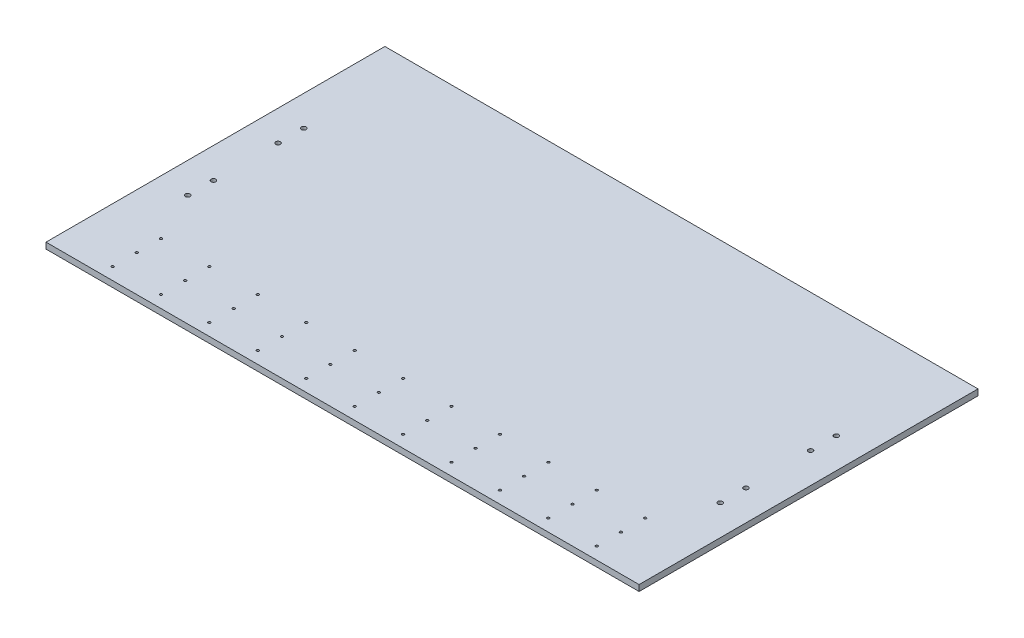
ISO-10303-21;
HEADER;
FILE_DESCRIPTION(('STEP AP214'),'2;1');
FILE_NAME('part.step','',(''),(''),'','','');
FILE_SCHEMA(('AUTOMOTIVE_DESIGN { 1 0 10303 214 1 1 1 1 }'));
ENDSEC;
DATA;
#1=APPLICATION_CONTEXT('core data for automotive mechanical design processes');
#2=APPLICATION_PROTOCOL_DEFINITION('international standard','automotive_design',2000,#1);
#3=PRODUCT_CONTEXT('',#1,'mechanical');
#4=PRODUCT('Part','Part','',(#3));
#5=PRODUCT_RELATED_PRODUCT_CATEGORY('part','',(#4));
#6=PRODUCT_DEFINITION_FORMATION('','',#4);
#7=PRODUCT_DEFINITION_CONTEXT('part definition',#1,'design');
#8=PRODUCT_DEFINITION('design','',#6,#7);
#9=PRODUCT_DEFINITION_SHAPE('','',#8);
#10=(LENGTH_UNIT() NAMED_UNIT(*) SI_UNIT(.MILLI.,.METRE.));
#11=(NAMED_UNIT(*) PLANE_ANGLE_UNIT() SI_UNIT($,.RADIAN.));
#12=(NAMED_UNIT(*) SI_UNIT($,.STERADIAN.) SOLID_ANGLE_UNIT());
#13=UNCERTAINTY_MEASURE_WITH_UNIT(LENGTH_MEASURE(1.E-05),#10,'distance_accuracy_value','');
#14=(GEOMETRIC_REPRESENTATION_CONTEXT(3) GLOBAL_UNCERTAINTY_ASSIGNED_CONTEXT((#13)) GLOBAL_UNIT_ASSIGNED_CONTEXT((#10,
#11,#12)) REPRESENTATION_CONTEXT('',''));
#15=CARTESIAN_POINT('',(0.,0.,0.));
#16=DIRECTION('',(0.,0.,1.));
#17=DIRECTION('',(1.,0.,0.));
#18=AXIS2_PLACEMENT_3D('',#15,#16,#17);
#19=CARTESIAN_POINT('',(622.3,12.7,-355.6));
#20=DIRECTION('',(-1.,0.,0.));
#21=DIRECTION('',(0.,0.,1.));
#22=AXIS2_PLACEMENT_3D('',#19,#20,#21);
#23=PLANE('',#22);
#24=DIRECTION('',(0.,0.,-1.));
#25=VECTOR('',#24,1.);
#26=CARTESIAN_POINT('',(622.3,0.,-355.6));
#27=LINE('',#26,#25);
#28=CARTESIAN_POINT('',(622.3,0.,355.6));
#29=VERTEX_POINT('',#28);
#30=CARTESIAN_POINT('',(622.3,0.,-355.6));
#31=VERTEX_POINT('',#30);
#32=EDGE_CURVE('E103',#29,#31,#27,.T.);
#33=ORIENTED_EDGE('',*,*,#32,.T.);
#34=DIRECTION('',(0.,-1.,0.));
#35=VECTOR('',#34,1.);
#36=CARTESIAN_POINT('',(622.3,12.7,-355.6));
#37=LINE('',#36,#35);
#38=CARTESIAN_POINT('',(622.3,12.7,-355.6));
#39=VERTEX_POINT('',#38);
#40=EDGE_CURVE('E94',#39,#31,#37,.T.);
#41=ORIENTED_EDGE('',*,*,#40,.F.);
#42=DIRECTION('',(0.,0.,-1.));
#43=VECTOR('',#42,1.);
#44=CARTESIAN_POINT('',(622.3,12.7,-355.6));
#45=LINE('',#44,#43);
#46=CARTESIAN_POINT('',(622.3,12.7,355.6));
#47=VERTEX_POINT('',#46);
#48=EDGE_CURVE('E88',#47,#39,#45,.T.);
#49=ORIENTED_EDGE('',*,*,#48,.F.);
#50=DIRECTION('',(0.,-1.,0.));
#51=VECTOR('',#50,1.);
#52=CARTESIAN_POINT('',(622.3,12.7,355.6));
#53=LINE('',#52,#51);
#54=EDGE_CURVE('E99',#47,#29,#53,.T.);
#55=ORIENTED_EDGE('',*,*,#54,.T.);
#56=EDGE_LOOP('',(#33,#41,#49,#55));
#57=FACE_BOUND('',#56,.T.);
#58=ADVANCED_FACE('F34',(#57),#23,.F.);
#59=CARTESIAN_POINT('',(-622.3,12.7,-355.6));
#60=DIRECTION('',(0.,0.,1.));
#61=DIRECTION('',(1.,0.,0.));
#62=AXIS2_PLACEMENT_3D('',#59,#60,#61);
#63=PLANE('',#62);
#64=DIRECTION('',(-1.,0.,0.));
#65=VECTOR('',#64,1.);
#66=CARTESIAN_POINT('',(-622.3,0.,-355.6));
#67=LINE('',#66,#65);
#68=CARTESIAN_POINT('',(-622.3,0.,-355.6));
#69=VERTEX_POINT('',#68);
#70=EDGE_CURVE('E93',#31,#69,#67,.T.);
#71=ORIENTED_EDGE('',*,*,#70,.T.);
#72=DIRECTION('',(0.,-1.,0.));
#73=VECTOR('',#72,1.);
#74=CARTESIAN_POINT('',(-622.3,12.7,-355.6));
#75=LINE('',#74,#73);
#76=CARTESIAN_POINT('',(-622.3,12.7,-355.6));
#77=VERTEX_POINT('',#76);
#78=EDGE_CURVE('E91',#77,#69,#75,.T.);
#79=ORIENTED_EDGE('',*,*,#78,.F.);
#80=DIRECTION('',(-1.,0.,0.));
#81=VECTOR('',#80,1.);
#82=CARTESIAN_POINT('',(-622.3,12.7,-355.6));
#83=LINE('',#82,#81);
#84=EDGE_CURVE('E82',#39,#77,#83,.T.);
#85=ORIENTED_EDGE('',*,*,#84,.F.);
#86=ORIENTED_EDGE('',*,*,#40,.T.);
#87=EDGE_LOOP('',(#71,#79,#85,#86));
#88=FACE_BOUND('',#87,.T.);
#89=ADVANCED_FACE('F92',(#88),#63,.F.);
#90=CARTESIAN_POINT('',(-622.3,12.7,-355.6));
#91=DIRECTION('',(1.,0.,0.));
#92=DIRECTION('',(0.,0.,-1.));
#93=AXIS2_PLACEMENT_3D('',#90,#91,#92);
#94=PLANE('',#93);
#95=DIRECTION('',(0.,0.,1.));
#96=VECTOR('',#95,1.);
#97=CARTESIAN_POINT('',(-622.3,0.,-355.6));
#98=LINE('',#97,#96);
#99=CARTESIAN_POINT('',(-622.3,0.,355.6));
#100=VERTEX_POINT('',#99);
#101=EDGE_CURVE('E68',#69,#100,#98,.T.);
#102=ORIENTED_EDGE('',*,*,#101,.T.);
#103=DIRECTION('',(0.,-1.,0.));
#104=VECTOR('',#103,1.);
#105=CARTESIAN_POINT('',(-622.3,12.7,355.6));
#106=LINE('',#105,#104);
#107=CARTESIAN_POINT('',(-622.3,12.7,355.6));
#108=VERTEX_POINT('',#107);
#109=EDGE_CURVE('E95',#108,#100,#106,.T.);
#110=ORIENTED_EDGE('',*,*,#109,.F.);
#111=DIRECTION('',(0.,0.,1.));
#112=VECTOR('',#111,1.);
#113=CARTESIAN_POINT('',(-622.3,12.7,-355.6));
#114=LINE('',#113,#112);
#115=EDGE_CURVE('E86',#77,#108,#114,.T.);
#116=ORIENTED_EDGE('',*,*,#115,.F.);
#117=ORIENTED_EDGE('',*,*,#78,.T.);
#118=EDGE_LOOP('',(#102,#110,#116,#117));
#119=FACE_BOUND('',#118,.T.);
#120=ADVANCED_FACE('F97',(#119),#94,.F.);
#121=CARTESIAN_POINT('',(-622.3,12.7,355.6));
#122=DIRECTION('',(0.,0.,-1.));
#123=DIRECTION('',(-1.,0.,0.));
#124=AXIS2_PLACEMENT_3D('',#121,#122,#123);
#125=PLANE('',#124);
#126=DIRECTION('',(1.,0.,0.));
#127=VECTOR('',#126,1.);
#128=CARTESIAN_POINT('',(-622.3,0.,355.6));
#129=LINE('',#128,#127);
#130=EDGE_CURVE('E74',#100,#29,#129,.T.);
#131=ORIENTED_EDGE('',*,*,#130,.T.);
#132=ORIENTED_EDGE('',*,*,#54,.F.);
#133=DIRECTION('',(1.,0.,0.));
#134=VECTOR('',#133,1.);
#135=CARTESIAN_POINT('',(-622.3,12.7,355.6));
#136=LINE('',#135,#134);
#137=EDGE_CURVE('E51',#108,#47,#136,.T.);
#138=ORIENTED_EDGE('',*,*,#137,.F.);
#139=ORIENTED_EDGE('',*,*,#109,.T.);
#140=EDGE_LOOP('',(#131,#132,#138,#139));
#141=FACE_BOUND('',#140,.T.);
#142=ADVANCED_FACE('F297',(#141),#125,.F.);
#143=CARTESIAN_POINT('',(0.,12.7,0.));
#144=DIRECTION('',(0.,1.,0.));
#145=DIRECTION('',(0.,0.,1.));
#146=AXIS2_PLACEMENT_3D('',#143,#144,#145);
#147=PLANE('',#146);
#148=CARTESIAN_POINT('',(-406.4,12.7,330.2));
#149=DIRECTION('',(0.,1.,0.));
#150=DIRECTION('',(0.,0.,1.));
#151=AXIS2_PLACEMENT_3D('',#148,#149,#150);
#152=CIRCLE('',#151,2.55269999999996);
#153=CARTESIAN_POINT('',(-406.4,12.7,332.7527));
#154=VERTEX_POINT('',#153);
#155=EDGE_CURVE('E880',#154,#154,#152,.T.);
#156=ORIENTED_EDGE('',*,*,#155,.F.);
#157=EDGE_LOOP('',(#156));
#158=FACE_BOUND('',#157,.T.);
#159=CARTESIAN_POINT('',(-406.4,12.7,279.4));
#160=DIRECTION('',(0.,1.,0.));
#161=DIRECTION('',(0.,0.,1.));
#162=AXIS2_PLACEMENT_3D('',#159,#160,#161);
#163=CIRCLE('',#162,2.55269999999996);
#164=CARTESIAN_POINT('',(-406.4,12.7,281.9527));
#165=VERTEX_POINT('',#164);
#166=EDGE_CURVE('E874',#165,#165,#163,.T.);
#167=ORIENTED_EDGE('',*,*,#166,.F.);
#168=EDGE_LOOP('',(#167));
#169=FACE_BOUND('',#168,.T.);
#170=CARTESIAN_POINT('',(-508.,12.7,330.2));
#171=DIRECTION('',(0.,1.,0.));
#172=DIRECTION('',(0.,0.,1.));
#173=AXIS2_PLACEMENT_3D('',#170,#171,#172);
#174=CIRCLE('',#173,2.55269999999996);
#175=CARTESIAN_POINT('',(-508.,12.7,332.7527));
#176=VERTEX_POINT('',#175);
#177=EDGE_CURVE('E871',#176,#176,#174,.T.);
#178=ORIENTED_EDGE('',*,*,#177,.F.);
#179=EDGE_LOOP('',(#178));
#180=FACE_BOUND('',#179,.T.);
#181=CARTESIAN_POINT('',(-558.8,12.7,-121.840625));
#182=DIRECTION('',(0.,1.,0.));
#183=DIRECTION('',(0.,0.,1.));
#184=AXIS2_PLACEMENT_3D('',#181,#182,#183);
#185=CIRCLE('',#184,4.90219999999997);
#186=CARTESIAN_POINT('',(-558.8,12.7,-116.938425));
#187=VERTEX_POINT('',#186);
#188=EDGE_CURVE('E865',#187,#187,#185,.T.);
#189=ORIENTED_EDGE('',*,*,#188,.F.);
#190=EDGE_LOOP('',(#189));
#191=FACE_BOUND('',#190,.T.);
#192=CARTESIAN_POINT('',(-558.8,12.7,-67.865625));
#193=DIRECTION('',(0.,1.,0.));
#194=DIRECTION('',(0.,0.,1.));
#195=AXIS2_PLACEMENT_3D('',#192,#193,#194);
#196=CIRCLE('',#195,4.90219999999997);
#197=CARTESIAN_POINT('',(-558.8,12.7,-62.963425));
#198=VERTEX_POINT('',#197);
#199=EDGE_CURVE('E859',#198,#198,#196,.T.);
#200=ORIENTED_EDGE('',*,*,#199,.F.);
#201=EDGE_LOOP('',(#200));
#202=FACE_BOUND('',#201,.T.);
#203=CARTESIAN_POINT('',(-558.8,12.7,67.865625));
#204=DIRECTION('',(0.,1.,0.));
#205=DIRECTION('',(0.,0.,1.));
#206=AXIS2_PLACEMENT_3D('',#203,#204,#205);
#207=CIRCLE('',#206,4.90219999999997);
#208=CARTESIAN_POINT('',(-558.8,12.7,72.767825));
#209=VERTEX_POINT('',#208);
#210=EDGE_CURVE('E853',#209,#209,#207,.T.);
#211=ORIENTED_EDGE('',*,*,#210,.F.);
#212=EDGE_LOOP('',(#211));
#213=FACE_BOUND('',#212,.T.);
#214=CARTESIAN_POINT('',(-558.8,12.7,121.840625));
#215=DIRECTION('',(0.,1.,0.));
#216=DIRECTION('',(0.,0.,1.));
#217=AXIS2_PLACEMENT_3D('',#214,#215,#216);
#218=CIRCLE('',#217,4.90219999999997);
#219=CARTESIAN_POINT('',(-558.8,12.7,126.742825));
#220=VERTEX_POINT('',#219);
#221=EDGE_CURVE('E847',#220,#220,#218,.T.);
#222=ORIENTED_EDGE('',*,*,#221,.F.);
#223=EDGE_LOOP('',(#222));
#224=FACE_BOUND('',#223,.T.);
#225=CARTESIAN_POINT('',(558.8,12.7,-67.865625));
#226=DIRECTION('',(0.,1.,0.));
#227=DIRECTION('',(0.,0.,1.));
#228=AXIS2_PLACEMENT_3D('',#225,#226,#227);
#229=CIRCLE('',#228,4.90219999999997);
#230=CARTESIAN_POINT('',(558.8,12.7,-62.963425));
#231=VERTEX_POINT('',#230);
#232=EDGE_CURVE('E841',#231,#231,#229,.T.);
#233=ORIENTED_EDGE('',*,*,#232,.F.);
#234=EDGE_LOOP('',(#233));
#235=FACE_BOUND('',#234,.T.);
#236=CARTESIAN_POINT('',(558.8,12.7,-121.840625));
#237=DIRECTION('',(0.,1.,0.));
#238=DIRECTION('',(0.,0.,1.));
#239=AXIS2_PLACEMENT_3D('',#236,#237,#238);
#240=CIRCLE('',#239,4.90219999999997);
#241=CARTESIAN_POINT('',(558.8,12.7,-116.938425));
#242=VERTEX_POINT('',#241);
#243=EDGE_CURVE('E835',#242,#242,#240,.T.);
#244=ORIENTED_EDGE('',*,*,#243,.F.);
#245=EDGE_LOOP('',(#244));
#246=FACE_BOUND('',#245,.T.);
#247=CARTESIAN_POINT('',(558.8,12.7,67.865625));
#248=DIRECTION('',(0.,1.,0.));
#249=DIRECTION('',(0.,0.,1.));
#250=AXIS2_PLACEMENT_3D('',#247,#248,#249);
#251=CIRCLE('',#250,4.90219999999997);
#252=CARTESIAN_POINT('',(558.8,12.7,72.767825));
#253=VERTEX_POINT('',#252);
#254=EDGE_CURVE('E827',#253,#253,#251,.T.);
#255=ORIENTED_EDGE('',*,*,#254,.F.);
#256=EDGE_LOOP('',(#255));
#257=FACE_BOUND('',#256,.T.);
#258=CARTESIAN_POINT('',(558.8,12.7,121.840625));
#259=DIRECTION('',(0.,1.,0.));
#260=DIRECTION('',(0.,0.,1.));
#261=AXIS2_PLACEMENT_3D('',#258,#259,#260);
#262=CIRCLE('',#261,4.90219999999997);
#263=CARTESIAN_POINT('',(558.8,12.7,126.742825));
#264=VERTEX_POINT('',#263);
#265=EDGE_CURVE('E821',#264,#264,#262,.T.);
#266=ORIENTED_EDGE('',*,*,#265,.F.);
#267=EDGE_LOOP('',(#266));
#268=FACE_BOUND('',#267,.T.);
#269=ORIENTED_EDGE('',*,*,#48,.T.);
#270=ORIENTED_EDGE('',*,*,#84,.T.);
#271=ORIENTED_EDGE('',*,*,#115,.T.);
#272=ORIENTED_EDGE('',*,*,#137,.T.);
#273=EDGE_LOOP('',(#269,#270,#271,#272));
#274=FACE_BOUND('',#273,.T.);
#275=CARTESIAN_POINT('',(-304.8,12.7,279.4));
#276=DIRECTION('',(0.,1.,0.));
#277=DIRECTION('',(0.,0.,1.));
#278=AXIS2_PLACEMENT_3D('',#275,#276,#277);
#279=CIRCLE('',#278,2.55269999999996);
#280=CARTESIAN_POINT('',(-304.8,12.7,281.9527));
#281=VERTEX_POINT('',#280);
#282=EDGE_CURVE('E116',#281,#281,#279,.T.);
#283=ORIENTED_EDGE('',*,*,#282,.F.);
#284=EDGE_LOOP('',(#283));
#285=FACE_BOUND('',#284,.T.);
#286=CARTESIAN_POINT('',(-203.2,12.7,279.4));
#287=DIRECTION('',(0.,1.,0.));
#288=DIRECTION('',(0.,0.,1.));
#289=AXIS2_PLACEMENT_3D('',#286,#287,#288);
#290=CIRCLE('',#289,2.55269999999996);
#291=CARTESIAN_POINT('',(-203.2,12.7,281.9527));
#292=VERTEX_POINT('',#291);
#293=EDGE_CURVE('E122',#292,#292,#290,.T.);
#294=ORIENTED_EDGE('',*,*,#293,.F.);
#295=EDGE_LOOP('',(#294));
#296=FACE_BOUND('',#295,.T.);
#297=CARTESIAN_POINT('',(-101.6,12.7,279.4));
#298=DIRECTION('',(0.,1.,0.));
#299=DIRECTION('',(0.,0.,1.));
#300=AXIS2_PLACEMENT_3D('',#297,#298,#299);
#301=CIRCLE('',#300,2.55269999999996);
#302=CARTESIAN_POINT('',(-101.6,12.7,281.9527));
#303=VERTEX_POINT('',#302);
#304=EDGE_CURVE('E128',#303,#303,#301,.T.);
#305=ORIENTED_EDGE('',*,*,#304,.F.);
#306=EDGE_LOOP('',(#305));
#307=FACE_BOUND('',#306,.T.);
#308=CARTESIAN_POINT('',(-1.11022302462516E-13,12.7,279.4));
#309=DIRECTION('',(0.,1.,0.));
#310=DIRECTION('',(0.,0.,1.));
#311=AXIS2_PLACEMENT_3D('',#308,#309,#310);
#312=CIRCLE('',#311,2.55269999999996);
#313=CARTESIAN_POINT('',(-1.11022302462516E-13,12.7,281.9527));
#314=VERTEX_POINT('',#313);
#315=EDGE_CURVE('E134',#314,#314,#312,.T.);
#316=ORIENTED_EDGE('',*,*,#315,.F.);
#317=EDGE_LOOP('',(#316));
#318=FACE_BOUND('',#317,.T.);
#319=CARTESIAN_POINT('',(101.6,12.7,279.4));
#320=DIRECTION('',(0.,1.,0.));
#321=DIRECTION('',(0.,0.,1.));
#322=AXIS2_PLACEMENT_3D('',#319,#320,#321);
#323=CIRCLE('',#322,2.55269999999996);
#324=CARTESIAN_POINT('',(101.6,12.7,281.9527));
#325=VERTEX_POINT('',#324);
#326=EDGE_CURVE('E140',#325,#325,#323,.T.);
#327=ORIENTED_EDGE('',*,*,#326,.F.);
#328=EDGE_LOOP('',(#327));
#329=FACE_BOUND('',#328,.T.);
#330=CARTESIAN_POINT('',(203.2,12.7,279.4));
#331=DIRECTION('',(0.,1.,0.));
#332=DIRECTION('',(0.,0.,1.));
#333=AXIS2_PLACEMENT_3D('',#330,#331,#332);
#334=CIRCLE('',#333,2.55269999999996);
#335=CARTESIAN_POINT('',(203.2,12.7,281.9527));
#336=VERTEX_POINT('',#335);
#337=EDGE_CURVE('E146',#336,#336,#334,.T.);
#338=ORIENTED_EDGE('',*,*,#337,.F.);
#339=EDGE_LOOP('',(#338));
#340=FACE_BOUND('',#339,.T.);
#341=CARTESIAN_POINT('',(304.8,12.7,279.4));
#342=DIRECTION('',(0.,1.,0.));
#343=DIRECTION('',(0.,0.,1.));
#344=AXIS2_PLACEMENT_3D('',#341,#342,#343);
#345=CIRCLE('',#344,2.55269999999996);
#346=CARTESIAN_POINT('',(304.8,12.7,281.9527));
#347=VERTEX_POINT('',#346);
#348=EDGE_CURVE('E152',#347,#347,#345,.T.);
#349=ORIENTED_EDGE('',*,*,#348,.F.);
#350=EDGE_LOOP('',(#349));
#351=FACE_BOUND('',#350,.T.);
#352=CARTESIAN_POINT('',(406.4,12.7,279.4));
#353=DIRECTION('',(0.,1.,0.));
#354=DIRECTION('',(0.,0.,1.));
#355=AXIS2_PLACEMENT_3D('',#352,#353,#354);
#356=CIRCLE('',#355,2.55269999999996);
#357=CARTESIAN_POINT('',(406.4,12.7,281.9527));
#358=VERTEX_POINT('',#357);
#359=EDGE_CURVE('E158',#358,#358,#356,.T.);
#360=ORIENTED_EDGE('',*,*,#359,.F.);
#361=EDGE_LOOP('',(#360));
#362=FACE_BOUND('',#361,.T.);
#363=CARTESIAN_POINT('',(-304.8,12.7,330.2));
#364=DIRECTION('',(0.,1.,0.));
#365=DIRECTION('',(0.,0.,1.));
#366=AXIS2_PLACEMENT_3D('',#363,#364,#365);
#367=CIRCLE('',#366,2.55269999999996);
#368=CARTESIAN_POINT('',(-304.8,12.7,332.7527));
#369=VERTEX_POINT('',#368);
#370=EDGE_CURVE('E164',#369,#369,#367,.T.);
#371=ORIENTED_EDGE('',*,*,#370,.F.);
#372=EDGE_LOOP('',(#371));
#373=FACE_BOUND('',#372,.T.);
#374=CARTESIAN_POINT('',(-203.2,12.7,330.2));
#375=DIRECTION('',(0.,1.,0.));
#376=DIRECTION('',(0.,0.,1.));
#377=AXIS2_PLACEMENT_3D('',#374,#375,#376);
#378=CIRCLE('',#377,2.55269999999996);
#379=CARTESIAN_POINT('',(-203.2,12.7,332.7527));
#380=VERTEX_POINT('',#379);
#381=EDGE_CURVE('E170',#380,#380,#378,.T.);
#382=ORIENTED_EDGE('',*,*,#381,.F.);
#383=EDGE_LOOP('',(#382));
#384=FACE_BOUND('',#383,.T.);
#385=CARTESIAN_POINT('',(-101.6,12.7,330.2));
#386=DIRECTION('',(0.,1.,0.));
#387=DIRECTION('',(0.,0.,1.));
#388=AXIS2_PLACEMENT_3D('',#385,#386,#387);
#389=CIRCLE('',#388,2.55269999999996);
#390=CARTESIAN_POINT('',(-101.6,12.7,332.7527));
#391=VERTEX_POINT('',#390);
#392=EDGE_CURVE('E176',#391,#391,#389,.T.);
#393=ORIENTED_EDGE('',*,*,#392,.F.);
#394=EDGE_LOOP('',(#393));
#395=FACE_BOUND('',#394,.T.);
#396=CARTESIAN_POINT('',(-1.11022302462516E-13,12.7,330.2));
#397=DIRECTION('',(0.,1.,0.));
#398=DIRECTION('',(0.,0.,1.));
#399=AXIS2_PLACEMENT_3D('',#396,#397,#398);
#400=CIRCLE('',#399,2.55269999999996);
#401=CARTESIAN_POINT('',(-1.11022302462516E-13,12.7,332.7527));
#402=VERTEX_POINT('',#401);
#403=EDGE_CURVE('E182',#402,#402,#400,.T.);
#404=ORIENTED_EDGE('',*,*,#403,.F.);
#405=EDGE_LOOP('',(#404));
#406=FACE_BOUND('',#405,.T.);
#407=CARTESIAN_POINT('',(101.6,12.7,330.2));
#408=DIRECTION('',(0.,1.,0.));
#409=DIRECTION('',(0.,0.,1.));
#410=AXIS2_PLACEMENT_3D('',#407,#408,#409);
#411=CIRCLE('',#410,2.55269999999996);
#412=CARTESIAN_POINT('',(101.6,12.7,332.7527));
#413=VERTEX_POINT('',#412);
#414=EDGE_CURVE('E188',#413,#413,#411,.T.);
#415=ORIENTED_EDGE('',*,*,#414,.F.);
#416=EDGE_LOOP('',(#415));
#417=FACE_BOUND('',#416,.T.);
#418=CARTESIAN_POINT('',(203.2,12.7,330.2));
#419=DIRECTION('',(0.,1.,0.));
#420=DIRECTION('',(0.,0.,1.));
#421=AXIS2_PLACEMENT_3D('',#418,#419,#420);
#422=CIRCLE('',#421,2.55269999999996);
#423=CARTESIAN_POINT('',(203.2,12.7,332.7527));
#424=VERTEX_POINT('',#423);
#425=EDGE_CURVE('E194',#424,#424,#422,.T.);
#426=ORIENTED_EDGE('',*,*,#425,.F.);
#427=EDGE_LOOP('',(#426));
#428=FACE_BOUND('',#427,.T.);
#429=CARTESIAN_POINT('',(304.8,12.7,330.2));
#430=DIRECTION('',(0.,1.,0.));
#431=DIRECTION('',(0.,0.,1.));
#432=AXIS2_PLACEMENT_3D('',#429,#430,#431);
#433=CIRCLE('',#432,2.55269999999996);
#434=CARTESIAN_POINT('',(304.8,12.7,332.7527));
#435=VERTEX_POINT('',#434);
#436=EDGE_CURVE('E200',#435,#435,#433,.T.);
#437=ORIENTED_EDGE('',*,*,#436,.F.);
#438=EDGE_LOOP('',(#437));
#439=FACE_BOUND('',#438,.T.);
#440=CARTESIAN_POINT('',(406.4,12.7,330.2));
#441=DIRECTION('',(0.,1.,0.));
#442=DIRECTION('',(0.,0.,1.));
#443=AXIS2_PLACEMENT_3D('',#440,#441,#442);
#444=CIRCLE('',#443,2.55269999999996);
#445=CARTESIAN_POINT('',(406.4,12.7,332.7527));
#446=VERTEX_POINT('',#445);
#447=EDGE_CURVE('E206',#446,#446,#444,.T.);
#448=ORIENTED_EDGE('',*,*,#447,.F.);
#449=EDGE_LOOP('',(#448));
#450=FACE_BOUND('',#449,.T.);
#451=CARTESIAN_POINT('',(508.,12.7,330.2));
#452=DIRECTION('',(0.,1.,0.));
#453=DIRECTION('',(0.,0.,1.));
#454=AXIS2_PLACEMENT_3D('',#451,#452,#453);
#455=CIRCLE('',#454,2.55269999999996);
#456=CARTESIAN_POINT('',(508.,12.7,332.7527));
#457=VERTEX_POINT('',#456);
#458=EDGE_CURVE('E212',#457,#457,#455,.T.);
#459=ORIENTED_EDGE('',*,*,#458,.F.);
#460=EDGE_LOOP('',(#459));
#461=FACE_BOUND('',#460,.T.);
#462=CARTESIAN_POINT('',(-508.,12.7,279.4));
#463=DIRECTION('',(0.,1.,0.));
#464=DIRECTION('',(0.,0.,1.));
#465=AXIS2_PLACEMENT_3D('',#462,#463,#464);
#466=CIRCLE('',#465,2.55269999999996);
#467=CARTESIAN_POINT('',(-508.,12.7,281.9527));
#468=VERTEX_POINT('',#467);
#469=EDGE_CURVE('E218',#468,#468,#466,.T.);
#470=ORIENTED_EDGE('',*,*,#469,.F.);
#471=EDGE_LOOP('',(#470));
#472=FACE_BOUND('',#471,.T.);
#473=CARTESIAN_POINT('',(508.,12.7,279.4));
#474=DIRECTION('',(0.,1.,0.));
#475=DIRECTION('',(0.,0.,1.));
#476=AXIS2_PLACEMENT_3D('',#473,#474,#475);
#477=CIRCLE('',#476,2.55269999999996);
#478=CARTESIAN_POINT('',(508.,12.7,281.9527));
#479=VERTEX_POINT('',#478);
#480=EDGE_CURVE('E224',#479,#479,#477,.T.);
#481=ORIENTED_EDGE('',*,*,#480,.F.);
#482=EDGE_LOOP('',(#481));
#483=FACE_BOUND('',#482,.T.);
#484=CARTESIAN_POINT('',(-508.,12.7,228.6));
#485=DIRECTION('',(0.,1.,0.));
#486=DIRECTION('',(0.,0.,1.));
#487=AXIS2_PLACEMENT_3D('',#484,#485,#486);
#488=CIRCLE('',#487,2.55269999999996);
#489=CARTESIAN_POINT('',(-508.,12.7,231.1527));
#490=VERTEX_POINT('',#489);
#491=EDGE_CURVE('E230',#490,#490,#488,.T.);
#492=ORIENTED_EDGE('',*,*,#491,.F.);
#493=EDGE_LOOP('',(#492));
#494=FACE_BOUND('',#493,.T.);
#495=CARTESIAN_POINT('',(-406.4,12.7,228.6));
#496=DIRECTION('',(0.,1.,0.));
#497=DIRECTION('',(0.,0.,1.));
#498=AXIS2_PLACEMENT_3D('',#495,#496,#497);
#499=CIRCLE('',#498,2.55269999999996);
#500=CARTESIAN_POINT('',(-406.4,12.7,231.1527));
#501=VERTEX_POINT('',#500);
#502=EDGE_CURVE('E236',#501,#501,#499,.T.);
#503=ORIENTED_EDGE('',*,*,#502,.F.);
#504=EDGE_LOOP('',(#503));
#505=FACE_BOUND('',#504,.T.);
#506=CARTESIAN_POINT('',(-304.8,12.7,228.6));
#507=DIRECTION('',(0.,1.,0.));
#508=DIRECTION('',(0.,0.,1.));
#509=AXIS2_PLACEMENT_3D('',#506,#507,#508);
#510=CIRCLE('',#509,2.55269999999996);
#511=CARTESIAN_POINT('',(-304.8,12.7,231.1527));
#512=VERTEX_POINT('',#511);
#513=EDGE_CURVE('E242',#512,#512,#510,.T.);
#514=ORIENTED_EDGE('',*,*,#513,.F.);
#515=EDGE_LOOP('',(#514));
#516=FACE_BOUND('',#515,.T.);
#517=CARTESIAN_POINT('',(-203.2,12.7,228.6));
#518=DIRECTION('',(0.,1.,0.));
#519=DIRECTION('',(0.,0.,1.));
#520=AXIS2_PLACEMENT_3D('',#517,#518,#519);
#521=CIRCLE('',#520,2.55269999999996);
#522=CARTESIAN_POINT('',(-203.2,12.7,231.1527));
#523=VERTEX_POINT('',#522);
#524=EDGE_CURVE('E248',#523,#523,#521,.T.);
#525=ORIENTED_EDGE('',*,*,#524,.F.);
#526=EDGE_LOOP('',(#525));
#527=FACE_BOUND('',#526,.T.);
#528=CARTESIAN_POINT('',(-101.6,12.7,228.6));
#529=DIRECTION('',(0.,1.,0.));
#530=DIRECTION('',(0.,0.,1.));
#531=AXIS2_PLACEMENT_3D('',#528,#529,#530);
#532=CIRCLE('',#531,2.55269999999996);
#533=CARTESIAN_POINT('',(-101.6,12.7,231.1527));
#534=VERTEX_POINT('',#533);
#535=EDGE_CURVE('E254',#534,#534,#532,.T.);
#536=ORIENTED_EDGE('',*,*,#535,.F.);
#537=EDGE_LOOP('',(#536));
#538=FACE_BOUND('',#537,.T.);
#539=CARTESIAN_POINT('',(-1.11022302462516E-13,12.7,228.6));
#540=DIRECTION('',(0.,1.,0.));
#541=DIRECTION('',(0.,0.,1.));
#542=AXIS2_PLACEMENT_3D('',#539,#540,#541);
#543=CIRCLE('',#542,2.55269999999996);
#544=CARTESIAN_POINT('',(-1.11022302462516E-13,12.7,231.1527));
#545=VERTEX_POINT('',#544);
#546=EDGE_CURVE('E260',#545,#545,#543,.T.);
#547=ORIENTED_EDGE('',*,*,#546,.F.);
#548=EDGE_LOOP('',(#547));
#549=FACE_BOUND('',#548,.T.);
#550=CARTESIAN_POINT('',(101.6,12.7,228.6));
#551=DIRECTION('',(0.,1.,0.));
#552=DIRECTION('',(0.,0.,1.));
#553=AXIS2_PLACEMENT_3D('',#550,#551,#552);
#554=CIRCLE('',#553,2.55269999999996);
#555=CARTESIAN_POINT('',(101.6,12.7,231.1527));
#556=VERTEX_POINT('',#555);
#557=EDGE_CURVE('E266',#556,#556,#554,.T.);
#558=ORIENTED_EDGE('',*,*,#557,.F.);
#559=EDGE_LOOP('',(#558));
#560=FACE_BOUND('',#559,.T.);
#561=CARTESIAN_POINT('',(203.2,12.7,228.6));
#562=DIRECTION('',(0.,1.,0.));
#563=DIRECTION('',(0.,0.,1.));
#564=AXIS2_PLACEMENT_3D('',#561,#562,#563);
#565=CIRCLE('',#564,2.55269999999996);
#566=CARTESIAN_POINT('',(203.2,12.7,231.1527));
#567=VERTEX_POINT('',#566);
#568=EDGE_CURVE('E272',#567,#567,#565,.T.);
#569=ORIENTED_EDGE('',*,*,#568,.F.);
#570=EDGE_LOOP('',(#569));
#571=FACE_BOUND('',#570,.T.);
#572=CARTESIAN_POINT('',(304.8,12.7,228.6));
#573=DIRECTION('',(0.,1.,0.));
#574=DIRECTION('',(0.,0.,1.));
#575=AXIS2_PLACEMENT_3D('',#572,#573,#574);
#576=CIRCLE('',#575,2.55269999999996);
#577=CARTESIAN_POINT('',(304.8,12.7,231.1527));
#578=VERTEX_POINT('',#577);
#579=EDGE_CURVE('E278',#578,#578,#576,.T.);
#580=ORIENTED_EDGE('',*,*,#579,.F.);
#581=EDGE_LOOP('',(#580));
#582=FACE_BOUND('',#581,.T.);
#583=CARTESIAN_POINT('',(406.4,12.7,228.6));
#584=DIRECTION('',(0.,1.,0.));
#585=DIRECTION('',(0.,0.,1.));
#586=AXIS2_PLACEMENT_3D('',#583,#584,#585);
#587=CIRCLE('',#586,2.55269999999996);
#588=CARTESIAN_POINT('',(406.4,12.7,231.1527));
#589=VERTEX_POINT('',#588);
#590=EDGE_CURVE('E284',#589,#589,#587,.T.);
#591=ORIENTED_EDGE('',*,*,#590,.F.);
#592=EDGE_LOOP('',(#591));
#593=FACE_BOUND('',#592,.T.);
#594=CARTESIAN_POINT('',(508.,12.7,228.6));
#595=DIRECTION('',(0.,1.,0.));
#596=DIRECTION('',(0.,0.,1.));
#597=AXIS2_PLACEMENT_3D('',#594,#595,#596);
#598=CIRCLE('',#597,2.55269999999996);
#599=CARTESIAN_POINT('',(508.,12.7,231.1527));
#600=VERTEX_POINT('',#599);
#601=EDGE_CURVE('E11',#600,#600,#598,.T.);
#602=ORIENTED_EDGE('',*,*,#601,.F.);
#603=EDGE_LOOP('',(#602));
#604=FACE_BOUND('',#603,.T.);
#605=ADVANCED_FACE('F83',(#158,#169,#180,#191,#202,#213,#224,#235,#246,#257,#268,#274,#285,#296,
#307,#318,#329,#340,#351,#362,#373,#384,#395,#406,#417,#428,#439,#450,#461,#472,#483,#494,#505,
#516,#527,#538,#549,#560,#571,#582,#593,#604),#147,.T.);
#606=CARTESIAN_POINT('',(0.,0.,0.));
#607=DIRECTION('',(0.,1.,0.));
#608=DIRECTION('',(0.,0.,1.));
#609=AXIS2_PLACEMENT_3D('',#606,#607,#608);
#610=PLANE('',#609);
#611=CARTESIAN_POINT('',(-406.4,0.,330.2));
#612=DIRECTION('',(0.,1.,0.));
#613=DIRECTION('',(0.,0.,1.));
#614=AXIS2_PLACEMENT_3D('',#611,#612,#613);
#615=CIRCLE('',#614,2.55269999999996);
#616=CARTESIAN_POINT('',(-406.4,0.,332.7527));
#617=VERTEX_POINT('',#616);
#618=EDGE_CURVE('E883',#617,#617,#615,.T.);
#619=ORIENTED_EDGE('',*,*,#618,.T.);
#620=EDGE_LOOP('',(#619));
#621=FACE_BOUND('',#620,.T.);
#622=CARTESIAN_POINT('',(-406.4,0.,279.4));
#623=DIRECTION('',(0.,1.,0.));
#624=DIRECTION('',(0.,0.,1.));
#625=AXIS2_PLACEMENT_3D('',#622,#623,#624);
#626=CIRCLE('',#625,2.55269999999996);
#627=CARTESIAN_POINT('',(-406.4,0.,281.9527));
#628=VERTEX_POINT('',#627);
#629=EDGE_CURVE('E877',#628,#628,#626,.T.);
#630=ORIENTED_EDGE('',*,*,#629,.T.);
#631=EDGE_LOOP('',(#630));
#632=FACE_BOUND('',#631,.T.);
#633=CARTESIAN_POINT('',(-508.,0.,330.2));
#634=DIRECTION('',(0.,1.,0.));
#635=DIRECTION('',(0.,0.,1.));
#636=AXIS2_PLACEMENT_3D('',#633,#634,#635);
#637=CIRCLE('',#636,2.55269999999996);
#638=CARTESIAN_POINT('',(-508.,0.,332.7527));
#639=VERTEX_POINT('',#638);
#640=EDGE_CURVE('E868',#639,#639,#637,.T.);
#641=ORIENTED_EDGE('',*,*,#640,.T.);
#642=EDGE_LOOP('',(#641));
#643=FACE_BOUND('',#642,.T.);
#644=CARTESIAN_POINT('',(-558.8,0.,-121.840625));
#645=DIRECTION('',(0.,1.,0.));
#646=DIRECTION('',(0.,0.,1.));
#647=AXIS2_PLACEMENT_3D('',#644,#645,#646);
#648=CIRCLE('',#647,4.90219999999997);
#649=CARTESIAN_POINT('',(-558.8,0.,-116.938425));
#650=VERTEX_POINT('',#649);
#651=EDGE_CURVE('E862',#650,#650,#648,.T.);
#652=ORIENTED_EDGE('',*,*,#651,.T.);
#653=EDGE_LOOP('',(#652));
#654=FACE_BOUND('',#653,.T.);
#655=CARTESIAN_POINT('',(-558.8,0.,-67.865625));
#656=DIRECTION('',(0.,1.,0.));
#657=DIRECTION('',(0.,0.,1.));
#658=AXIS2_PLACEMENT_3D('',#655,#656,#657);
#659=CIRCLE('',#658,4.90219999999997);
#660=CARTESIAN_POINT('',(-558.8,0.,-62.963425));
#661=VERTEX_POINT('',#660);
#662=EDGE_CURVE('E856',#661,#661,#659,.T.);
#663=ORIENTED_EDGE('',*,*,#662,.T.);
#664=EDGE_LOOP('',(#663));
#665=FACE_BOUND('',#664,.T.);
#666=CARTESIAN_POINT('',(-558.8,0.,67.865625));
#667=DIRECTION('',(0.,1.,0.));
#668=DIRECTION('',(0.,0.,1.));
#669=AXIS2_PLACEMENT_3D('',#666,#667,#668);
#670=CIRCLE('',#669,4.90219999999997);
#671=CARTESIAN_POINT('',(-558.8,0.,72.767825));
#672=VERTEX_POINT('',#671);
#673=EDGE_CURVE('E850',#672,#672,#670,.T.);
#674=ORIENTED_EDGE('',*,*,#673,.T.);
#675=EDGE_LOOP('',(#674));
#676=FACE_BOUND('',#675,.T.);
#677=CARTESIAN_POINT('',(-558.8,0.,121.840625));
#678=DIRECTION('',(0.,1.,0.));
#679=DIRECTION('',(0.,0.,1.));
#680=AXIS2_PLACEMENT_3D('',#677,#678,#679);
#681=CIRCLE('',#680,4.90219999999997);
#682=CARTESIAN_POINT('',(-558.8,0.,126.742825));
#683=VERTEX_POINT('',#682);
#684=EDGE_CURVE('E844',#683,#683,#681,.T.);
#685=ORIENTED_EDGE('',*,*,#684,.T.);
#686=EDGE_LOOP('',(#685));
#687=FACE_BOUND('',#686,.T.);
#688=CARTESIAN_POINT('',(558.8,0.,-67.865625));
#689=DIRECTION('',(0.,1.,0.));
#690=DIRECTION('',(0.,0.,1.));
#691=AXIS2_PLACEMENT_3D('',#688,#689,#690);
#692=CIRCLE('',#691,4.90219999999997);
#693=CARTESIAN_POINT('',(558.8,0.,-62.963425));
#694=VERTEX_POINT('',#693);
#695=EDGE_CURVE('E838',#694,#694,#692,.T.);
#696=ORIENTED_EDGE('',*,*,#695,.T.);
#697=EDGE_LOOP('',(#696));
#698=FACE_BOUND('',#697,.T.);
#699=CARTESIAN_POINT('',(558.8,0.,-121.840625));
#700=DIRECTION('',(0.,1.,0.));
#701=DIRECTION('',(0.,0.,1.));
#702=AXIS2_PLACEMENT_3D('',#699,#700,#701);
#703=CIRCLE('',#702,4.90219999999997);
#704=CARTESIAN_POINT('',(558.8,0.,-116.938425));
#705=VERTEX_POINT('',#704);
#706=EDGE_CURVE('E832',#705,#705,#703,.T.);
#707=ORIENTED_EDGE('',*,*,#706,.T.);
#708=EDGE_LOOP('',(#707));
#709=FACE_BOUND('',#708,.T.);
#710=CARTESIAN_POINT('',(558.8,0.,67.865625));
#711=DIRECTION('',(0.,1.,0.));
#712=DIRECTION('',(0.,0.,1.));
#713=AXIS2_PLACEMENT_3D('',#710,#711,#712);
#714=CIRCLE('',#713,4.90219999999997);
#715=CARTESIAN_POINT('',(558.8,0.,72.767825));
#716=VERTEX_POINT('',#715);
#717=EDGE_CURVE('E823',#716,#716,#714,.T.);
#718=ORIENTED_EDGE('',*,*,#717,.T.);
#719=EDGE_LOOP('',(#718));
#720=FACE_BOUND('',#719,.T.);
#721=CARTESIAN_POINT('',(558.8,0.,121.840625));
#722=DIRECTION('',(0.,1.,0.));
#723=DIRECTION('',(0.,0.,1.));
#724=AXIS2_PLACEMENT_3D('',#721,#722,#723);
#725=CIRCLE('',#724,4.90219999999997);
#726=CARTESIAN_POINT('',(558.8,0.,126.742825));
#727=VERTEX_POINT('',#726);
#728=EDGE_CURVE('E106',#727,#727,#725,.T.);
#729=ORIENTED_EDGE('',*,*,#728,.T.);
#730=EDGE_LOOP('',(#729));
#731=FACE_BOUND('',#730,.T.);
#732=ORIENTED_EDGE('',*,*,#32,.F.);
#733=ORIENTED_EDGE('',*,*,#130,.F.);
#734=ORIENTED_EDGE('',*,*,#101,.F.);
#735=ORIENTED_EDGE('',*,*,#70,.F.);
#736=EDGE_LOOP('',(#732,#733,#734,#735));
#737=FACE_BOUND('',#736,.T.);
#738=CARTESIAN_POINT('',(-304.8,0.,279.4));
#739=DIRECTION('',(0.,1.,0.));
#740=DIRECTION('',(0.,0.,1.));
#741=AXIS2_PLACEMENT_3D('',#738,#739,#740);
#742=CIRCLE('',#741,2.55269999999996);
#743=CARTESIAN_POINT('',(-304.8,0.,281.9527));
#744=VERTEX_POINT('',#743);
#745=EDGE_CURVE('E113',#744,#744,#742,.T.);
#746=ORIENTED_EDGE('',*,*,#745,.T.);
#747=EDGE_LOOP('',(#746));
#748=FACE_BOUND('',#747,.T.);
#749=CARTESIAN_POINT('',(-203.2,0.,279.4));
#750=DIRECTION('',(0.,1.,0.));
#751=DIRECTION('',(0.,0.,1.));
#752=AXIS2_PLACEMENT_3D('',#749,#750,#751);
#753=CIRCLE('',#752,2.55269999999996);
#754=CARTESIAN_POINT('',(-203.2,0.,281.9527));
#755=VERTEX_POINT('',#754);
#756=EDGE_CURVE('E119',#755,#755,#753,.T.);
#757=ORIENTED_EDGE('',*,*,#756,.T.);
#758=EDGE_LOOP('',(#757));
#759=FACE_BOUND('',#758,.T.);
#760=CARTESIAN_POINT('',(-101.6,0.,279.4));
#761=DIRECTION('',(0.,1.,0.));
#762=DIRECTION('',(0.,0.,1.));
#763=AXIS2_PLACEMENT_3D('',#760,#761,#762);
#764=CIRCLE('',#763,2.55269999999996);
#765=CARTESIAN_POINT('',(-101.6,0.,281.9527));
#766=VERTEX_POINT('',#765);
#767=EDGE_CURVE('E125',#766,#766,#764,.T.);
#768=ORIENTED_EDGE('',*,*,#767,.T.);
#769=EDGE_LOOP('',(#768));
#770=FACE_BOUND('',#769,.T.);
#771=CARTESIAN_POINT('',(-1.11022302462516E-13,0.,279.4));
#772=DIRECTION('',(0.,1.,0.));
#773=DIRECTION('',(0.,0.,1.));
#774=AXIS2_PLACEMENT_3D('',#771,#772,#773);
#775=CIRCLE('',#774,2.55269999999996);
#776=CARTESIAN_POINT('',(-1.11022302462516E-13,0.,281.9527));
#777=VERTEX_POINT('',#776);
#778=EDGE_CURVE('E131',#777,#777,#775,.T.);
#779=ORIENTED_EDGE('',*,*,#778,.T.);
#780=EDGE_LOOP('',(#779));
#781=FACE_BOUND('',#780,.T.);
#782=CARTESIAN_POINT('',(101.6,0.,279.4));
#783=DIRECTION('',(0.,1.,0.));
#784=DIRECTION('',(0.,0.,1.));
#785=AXIS2_PLACEMENT_3D('',#782,#783,#784);
#786=CIRCLE('',#785,2.55269999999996);
#787=CARTESIAN_POINT('',(101.6,0.,281.9527));
#788=VERTEX_POINT('',#787);
#789=EDGE_CURVE('E137',#788,#788,#786,.T.);
#790=ORIENTED_EDGE('',*,*,#789,.T.);
#791=EDGE_LOOP('',(#790));
#792=FACE_BOUND('',#791,.T.);
#793=CARTESIAN_POINT('',(203.2,0.,279.4));
#794=DIRECTION('',(0.,1.,0.));
#795=DIRECTION('',(0.,0.,1.));
#796=AXIS2_PLACEMENT_3D('',#793,#794,#795);
#797=CIRCLE('',#796,2.55269999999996);
#798=CARTESIAN_POINT('',(203.2,0.,281.9527));
#799=VERTEX_POINT('',#798);
#800=EDGE_CURVE('E143',#799,#799,#797,.T.);
#801=ORIENTED_EDGE('',*,*,#800,.T.);
#802=EDGE_LOOP('',(#801));
#803=FACE_BOUND('',#802,.T.);
#804=CARTESIAN_POINT('',(304.8,0.,279.4));
#805=DIRECTION('',(0.,1.,0.));
#806=DIRECTION('',(0.,0.,1.));
#807=AXIS2_PLACEMENT_3D('',#804,#805,#806);
#808=CIRCLE('',#807,2.55269999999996);
#809=CARTESIAN_POINT('',(304.8,0.,281.9527));
#810=VERTEX_POINT('',#809);
#811=EDGE_CURVE('E149',#810,#810,#808,.T.);
#812=ORIENTED_EDGE('',*,*,#811,.T.);
#813=EDGE_LOOP('',(#812));
#814=FACE_BOUND('',#813,.T.);
#815=CARTESIAN_POINT('',(406.4,0.,279.4));
#816=DIRECTION('',(0.,1.,0.));
#817=DIRECTION('',(0.,0.,1.));
#818=AXIS2_PLACEMENT_3D('',#815,#816,#817);
#819=CIRCLE('',#818,2.55269999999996);
#820=CARTESIAN_POINT('',(406.4,0.,281.9527));
#821=VERTEX_POINT('',#820);
#822=EDGE_CURVE('E155',#821,#821,#819,.T.);
#823=ORIENTED_EDGE('',*,*,#822,.T.);
#824=EDGE_LOOP('',(#823));
#825=FACE_BOUND('',#824,.T.);
#826=CARTESIAN_POINT('',(-304.8,0.,330.2));
#827=DIRECTION('',(0.,1.,0.));
#828=DIRECTION('',(0.,0.,1.));
#829=AXIS2_PLACEMENT_3D('',#826,#827,#828);
#830=CIRCLE('',#829,2.55269999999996);
#831=CARTESIAN_POINT('',(-304.8,0.,332.7527));
#832=VERTEX_POINT('',#831);
#833=EDGE_CURVE('E161',#832,#832,#830,.T.);
#834=ORIENTED_EDGE('',*,*,#833,.T.);
#835=EDGE_LOOP('',(#834));
#836=FACE_BOUND('',#835,.T.);
#837=CARTESIAN_POINT('',(-203.2,0.,330.2));
#838=DIRECTION('',(0.,1.,0.));
#839=DIRECTION('',(0.,0.,1.));
#840=AXIS2_PLACEMENT_3D('',#837,#838,#839);
#841=CIRCLE('',#840,2.55269999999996);
#842=CARTESIAN_POINT('',(-203.2,0.,332.7527));
#843=VERTEX_POINT('',#842);
#844=EDGE_CURVE('E167',#843,#843,#841,.T.);
#845=ORIENTED_EDGE('',*,*,#844,.T.);
#846=EDGE_LOOP('',(#845));
#847=FACE_BOUND('',#846,.T.);
#848=CARTESIAN_POINT('',(-101.6,0.,330.2));
#849=DIRECTION('',(0.,1.,0.));
#850=DIRECTION('',(0.,0.,1.));
#851=AXIS2_PLACEMENT_3D('',#848,#849,#850);
#852=CIRCLE('',#851,2.55269999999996);
#853=CARTESIAN_POINT('',(-101.6,0.,332.7527));
#854=VERTEX_POINT('',#853);
#855=EDGE_CURVE('E173',#854,#854,#852,.T.);
#856=ORIENTED_EDGE('',*,*,#855,.T.);
#857=EDGE_LOOP('',(#856));
#858=FACE_BOUND('',#857,.T.);
#859=CARTESIAN_POINT('',(-1.11022302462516E-13,0.,330.2));
#860=DIRECTION('',(0.,1.,0.));
#861=DIRECTION('',(0.,0.,1.));
#862=AXIS2_PLACEMENT_3D('',#859,#860,#861);
#863=CIRCLE('',#862,2.55269999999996);
#864=CARTESIAN_POINT('',(-1.11022302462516E-13,0.,332.7527));
#865=VERTEX_POINT('',#864);
#866=EDGE_CURVE('E179',#865,#865,#863,.T.);
#867=ORIENTED_EDGE('',*,*,#866,.T.);
#868=EDGE_LOOP('',(#867));
#869=FACE_BOUND('',#868,.T.);
#870=CARTESIAN_POINT('',(101.6,0.,330.2));
#871=DIRECTION('',(0.,1.,0.));
#872=DIRECTION('',(0.,0.,1.));
#873=AXIS2_PLACEMENT_3D('',#870,#871,#872);
#874=CIRCLE('',#873,2.55269999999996);
#875=CARTESIAN_POINT('',(101.6,0.,332.7527));
#876=VERTEX_POINT('',#875);
#877=EDGE_CURVE('E185',#876,#876,#874,.T.);
#878=ORIENTED_EDGE('',*,*,#877,.T.);
#879=EDGE_LOOP('',(#878));
#880=FACE_BOUND('',#879,.T.);
#881=CARTESIAN_POINT('',(203.2,0.,330.2));
#882=DIRECTION('',(0.,1.,0.));
#883=DIRECTION('',(0.,0.,1.));
#884=AXIS2_PLACEMENT_3D('',#881,#882,#883);
#885=CIRCLE('',#884,2.55269999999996);
#886=CARTESIAN_POINT('',(203.2,0.,332.7527));
#887=VERTEX_POINT('',#886);
#888=EDGE_CURVE('E191',#887,#887,#885,.T.);
#889=ORIENTED_EDGE('',*,*,#888,.T.);
#890=EDGE_LOOP('',(#889));
#891=FACE_BOUND('',#890,.T.);
#892=CARTESIAN_POINT('',(304.8,0.,330.2));
#893=DIRECTION('',(0.,1.,0.));
#894=DIRECTION('',(0.,0.,1.));
#895=AXIS2_PLACEMENT_3D('',#892,#893,#894);
#896=CIRCLE('',#895,2.55269999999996);
#897=CARTESIAN_POINT('',(304.8,0.,332.7527));
#898=VERTEX_POINT('',#897);
#899=EDGE_CURVE('E197',#898,#898,#896,.T.);
#900=ORIENTED_EDGE('',*,*,#899,.T.);
#901=EDGE_LOOP('',(#900));
#902=FACE_BOUND('',#901,.T.);
#903=CARTESIAN_POINT('',(406.4,0.,330.2));
#904=DIRECTION('',(0.,1.,0.));
#905=DIRECTION('',(0.,0.,1.));
#906=AXIS2_PLACEMENT_3D('',#903,#904,#905);
#907=CIRCLE('',#906,2.55269999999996);
#908=CARTESIAN_POINT('',(406.4,0.,332.7527));
#909=VERTEX_POINT('',#908);
#910=EDGE_CURVE('E203',#909,#909,#907,.T.);
#911=ORIENTED_EDGE('',*,*,#910,.T.);
#912=EDGE_LOOP('',(#911));
#913=FACE_BOUND('',#912,.T.);
#914=CARTESIAN_POINT('',(508.,0.,330.2));
#915=DIRECTION('',(0.,1.,0.));
#916=DIRECTION('',(0.,0.,1.));
#917=AXIS2_PLACEMENT_3D('',#914,#915,#916);
#918=CIRCLE('',#917,2.55269999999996);
#919=CARTESIAN_POINT('',(508.,0.,332.7527));
#920=VERTEX_POINT('',#919);
#921=EDGE_CURVE('E209',#920,#920,#918,.T.);
#922=ORIENTED_EDGE('',*,*,#921,.T.);
#923=EDGE_LOOP('',(#922));
#924=FACE_BOUND('',#923,.T.);
#925=CARTESIAN_POINT('',(-508.,0.,279.4));
#926=DIRECTION('',(0.,1.,0.));
#927=DIRECTION('',(0.,0.,1.));
#928=AXIS2_PLACEMENT_3D('',#925,#926,#927);
#929=CIRCLE('',#928,2.55269999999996);
#930=CARTESIAN_POINT('',(-508.,0.,281.9527));
#931=VERTEX_POINT('',#930);
#932=EDGE_CURVE('E215',#931,#931,#929,.T.);
#933=ORIENTED_EDGE('',*,*,#932,.T.);
#934=EDGE_LOOP('',(#933));
#935=FACE_BOUND('',#934,.T.);
#936=CARTESIAN_POINT('',(508.,0.,279.4));
#937=DIRECTION('',(0.,1.,0.));
#938=DIRECTION('',(0.,0.,1.));
#939=AXIS2_PLACEMENT_3D('',#936,#937,#938);
#940=CIRCLE('',#939,2.55269999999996);
#941=CARTESIAN_POINT('',(508.,0.,281.9527));
#942=VERTEX_POINT('',#941);
#943=EDGE_CURVE('E221',#942,#942,#940,.T.);
#944=ORIENTED_EDGE('',*,*,#943,.T.);
#945=EDGE_LOOP('',(#944));
#946=FACE_BOUND('',#945,.T.);
#947=CARTESIAN_POINT('',(-508.,0.,228.6));
#948=DIRECTION('',(0.,1.,0.));
#949=DIRECTION('',(0.,0.,1.));
#950=AXIS2_PLACEMENT_3D('',#947,#948,#949);
#951=CIRCLE('',#950,2.55269999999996);
#952=CARTESIAN_POINT('',(-508.,0.,231.1527));
#953=VERTEX_POINT('',#952);
#954=EDGE_CURVE('E227',#953,#953,#951,.T.);
#955=ORIENTED_EDGE('',*,*,#954,.T.);
#956=EDGE_LOOP('',(#955));
#957=FACE_BOUND('',#956,.T.);
#958=CARTESIAN_POINT('',(-406.4,0.,228.6));
#959=DIRECTION('',(0.,1.,0.));
#960=DIRECTION('',(0.,0.,1.));
#961=AXIS2_PLACEMENT_3D('',#958,#959,#960);
#962=CIRCLE('',#961,2.55269999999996);
#963=CARTESIAN_POINT('',(-406.4,0.,231.1527));
#964=VERTEX_POINT('',#963);
#965=EDGE_CURVE('E233',#964,#964,#962,.T.);
#966=ORIENTED_EDGE('',*,*,#965,.T.);
#967=EDGE_LOOP('',(#966));
#968=FACE_BOUND('',#967,.T.);
#969=CARTESIAN_POINT('',(-304.8,0.,228.6));
#970=DIRECTION('',(0.,1.,0.));
#971=DIRECTION('',(0.,0.,1.));
#972=AXIS2_PLACEMENT_3D('',#969,#970,#971);
#973=CIRCLE('',#972,2.55269999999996);
#974=CARTESIAN_POINT('',(-304.8,0.,231.1527));
#975=VERTEX_POINT('',#974);
#976=EDGE_CURVE('E239',#975,#975,#973,.T.);
#977=ORIENTED_EDGE('',*,*,#976,.T.);
#978=EDGE_LOOP('',(#977));
#979=FACE_BOUND('',#978,.T.);
#980=CARTESIAN_POINT('',(-203.2,0.,228.6));
#981=DIRECTION('',(0.,1.,0.));
#982=DIRECTION('',(0.,0.,1.));
#983=AXIS2_PLACEMENT_3D('',#980,#981,#982);
#984=CIRCLE('',#983,2.55269999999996);
#985=CARTESIAN_POINT('',(-203.2,0.,231.1527));
#986=VERTEX_POINT('',#985);
#987=EDGE_CURVE('E245',#986,#986,#984,.T.);
#988=ORIENTED_EDGE('',*,*,#987,.T.);
#989=EDGE_LOOP('',(#988));
#990=FACE_BOUND('',#989,.T.);
#991=CARTESIAN_POINT('',(-101.6,0.,228.6));
#992=DIRECTION('',(0.,1.,0.));
#993=DIRECTION('',(0.,0.,1.));
#994=AXIS2_PLACEMENT_3D('',#991,#992,#993);
#995=CIRCLE('',#994,2.55269999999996);
#996=CARTESIAN_POINT('',(-101.6,0.,231.1527));
#997=VERTEX_POINT('',#996);
#998=EDGE_CURVE('E251',#997,#997,#995,.T.);
#999=ORIENTED_EDGE('',*,*,#998,.T.);
#1000=EDGE_LOOP('',(#999));
#1001=FACE_BOUND('',#1000,.T.);
#1002=CARTESIAN_POINT('',(-1.11022302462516E-13,0.,228.6));
#1003=DIRECTION('',(0.,1.,0.));
#1004=DIRECTION('',(0.,0.,1.));
#1005=AXIS2_PLACEMENT_3D('',#1002,#1003,#1004);
#1006=CIRCLE('',#1005,2.55269999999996);
#1007=CARTESIAN_POINT('',(-1.11022302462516E-13,0.,231.1527));
#1008=VERTEX_POINT('',#1007);
#1009=EDGE_CURVE('E257',#1008,#1008,#1006,.T.);
#1010=ORIENTED_EDGE('',*,*,#1009,.T.);
#1011=EDGE_LOOP('',(#1010));
#1012=FACE_BOUND('',#1011,.T.);
#1013=CARTESIAN_POINT('',(101.6,0.,228.6));
#1014=DIRECTION('',(0.,1.,0.));
#1015=DIRECTION('',(0.,0.,1.));
#1016=AXIS2_PLACEMENT_3D('',#1013,#1014,#1015);
#1017=CIRCLE('',#1016,2.55269999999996);
#1018=CARTESIAN_POINT('',(101.6,0.,231.1527));
#1019=VERTEX_POINT('',#1018);
#1020=EDGE_CURVE('E263',#1019,#1019,#1017,.T.);
#1021=ORIENTED_EDGE('',*,*,#1020,.T.);
#1022=EDGE_LOOP('',(#1021));
#1023=FACE_BOUND('',#1022,.T.);
#1024=CARTESIAN_POINT('',(203.2,0.,228.6));
#1025=DIRECTION('',(0.,1.,0.));
#1026=DIRECTION('',(0.,0.,1.));
#1027=AXIS2_PLACEMENT_3D('',#1024,#1025,#1026);
#1028=CIRCLE('',#1027,2.55269999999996);
#1029=CARTESIAN_POINT('',(203.2,0.,231.1527));
#1030=VERTEX_POINT('',#1029);
#1031=EDGE_CURVE('E269',#1030,#1030,#1028,.T.);
#1032=ORIENTED_EDGE('',*,*,#1031,.T.);
#1033=EDGE_LOOP('',(#1032));
#1034=FACE_BOUND('',#1033,.T.);
#1035=CARTESIAN_POINT('',(304.8,0.,228.6));
#1036=DIRECTION('',(0.,1.,0.));
#1037=DIRECTION('',(0.,0.,1.));
#1038=AXIS2_PLACEMENT_3D('',#1035,#1036,#1037);
#1039=CIRCLE('',#1038,2.55269999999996);
#1040=CARTESIAN_POINT('',(304.8,0.,231.1527));
#1041=VERTEX_POINT('',#1040);
#1042=EDGE_CURVE('E275',#1041,#1041,#1039,.T.);
#1043=ORIENTED_EDGE('',*,*,#1042,.T.);
#1044=EDGE_LOOP('',(#1043));
#1045=FACE_BOUND('',#1044,.T.);
#1046=CARTESIAN_POINT('',(406.4,0.,228.6));
#1047=DIRECTION('',(0.,1.,0.));
#1048=DIRECTION('',(0.,0.,1.));
#1049=AXIS2_PLACEMENT_3D('',#1046,#1047,#1048);
#1050=CIRCLE('',#1049,2.55269999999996);
#1051=CARTESIAN_POINT('',(406.4,0.,231.1527));
#1052=VERTEX_POINT('',#1051);
#1053=EDGE_CURVE('E281',#1052,#1052,#1050,.T.);
#1054=ORIENTED_EDGE('',*,*,#1053,.T.);
#1055=EDGE_LOOP('',(#1054));
#1056=FACE_BOUND('',#1055,.T.);
#1057=CARTESIAN_POINT('',(508.,0.,228.6));
#1058=DIRECTION('',(0.,1.,0.));
#1059=DIRECTION('',(0.,0.,1.));
#1060=AXIS2_PLACEMENT_3D('',#1057,#1058,#1059);
#1061=CIRCLE('',#1060,2.55269999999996);
#1062=CARTESIAN_POINT('',(508.,0.,231.1527));
#1063=VERTEX_POINT('',#1062);
#1064=EDGE_CURVE('E43',#1063,#1063,#1061,.T.);
#1065=ORIENTED_EDGE('',*,*,#1064,.T.);
#1066=EDGE_LOOP('',(#1065));
#1067=FACE_BOUND('',#1066,.T.);
#1068=ADVANCED_FACE('F289',(#621,#632,#643,#654,#665,#676,#687,#698,#709,#720,#731,#737,#748,
#759,#770,#781,#792,#803,#814,#825,#836,#847,#858,#869,#880,#891,#902,#913,#924,#935,#946,#957,
#968,#979,#990,#1001,#1012,#1023,#1034,#1045,#1056,#1067),#610,.F.);
#1069=CARTESIAN_POINT('',(558.8,12.7,121.840625));
#1070=DIRECTION('',(0.,1.,0.));
#1071=DIRECTION('',(0.,0.,1.));
#1072=AXIS2_PLACEMENT_3D('',#1069,#1070,#1071);
#1073=CYLINDRICAL_SURFACE('',#1072,4.90219999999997);
#1074=ORIENTED_EDGE('',*,*,#728,.F.);
#1075=EDGE_LOOP('',(#1074));
#1076=FACE_BOUND('',#1075,.T.);
#1077=ORIENTED_EDGE('',*,*,#265,.T.);
#1078=EDGE_LOOP('',(#1077));
#1079=FACE_BOUND('',#1078,.T.);
#1080=ADVANCED_FACE('F304',(#1076,#1079),#1073,.F.);
#1081=CARTESIAN_POINT('',(558.8,12.7,67.865625));
#1082=DIRECTION('',(0.,1.,0.));
#1083=DIRECTION('',(0.,0.,1.));
#1084=AXIS2_PLACEMENT_3D('',#1081,#1082,#1083);
#1085=CYLINDRICAL_SURFACE('',#1084,4.90219999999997);
#1086=ORIENTED_EDGE('',*,*,#717,.F.);
#1087=EDGE_LOOP('',(#1086));
#1088=FACE_BOUND('',#1087,.T.);
#1089=ORIENTED_EDGE('',*,*,#254,.T.);
#1090=EDGE_LOOP('',(#1089));
#1091=FACE_BOUND('',#1090,.T.);
#1092=ADVANCED_FACE('F740',(#1088,#1091),#1085,.F.);
#1093=CARTESIAN_POINT('',(558.8,12.7,-121.840625));
#1094=DIRECTION('',(0.,1.,0.));
#1095=DIRECTION('',(0.,0.,1.));
#1096=AXIS2_PLACEMENT_3D('',#1093,#1094,#1095);
#1097=CYLINDRICAL_SURFACE('',#1096,4.90219999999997);
#1098=ORIENTED_EDGE('',*,*,#706,.F.);
#1099=EDGE_LOOP('',(#1098));
#1100=FACE_BOUND('',#1099,.T.);
#1101=ORIENTED_EDGE('',*,*,#243,.T.);
#1102=EDGE_LOOP('',(#1101));
#1103=FACE_BOUND('',#1102,.T.);
#1104=ADVANCED_FACE('F732',(#1100,#1103),#1097,.F.);
#1105=CARTESIAN_POINT('',(558.8,12.7,-67.865625));
#1106=DIRECTION('',(0.,1.,0.));
#1107=DIRECTION('',(0.,0.,1.));
#1108=AXIS2_PLACEMENT_3D('',#1105,#1106,#1107);
#1109=CYLINDRICAL_SURFACE('',#1108,4.90219999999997);
#1110=ORIENTED_EDGE('',*,*,#695,.F.);
#1111=EDGE_LOOP('',(#1110));
#1112=FACE_BOUND('',#1111,.T.);
#1113=ORIENTED_EDGE('',*,*,#232,.T.);
#1114=EDGE_LOOP('',(#1113));
#1115=FACE_BOUND('',#1114,.T.);
#1116=ADVANCED_FACE('F724',(#1112,#1115),#1109,.F.);
#1117=CARTESIAN_POINT('',(-558.8,12.7,121.840625));
#1118=DIRECTION('',(0.,1.,0.));
#1119=DIRECTION('',(0.,0.,1.));
#1120=AXIS2_PLACEMENT_3D('',#1117,#1118,#1119);
#1121=CYLINDRICAL_SURFACE('',#1120,4.90219999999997);
#1122=ORIENTED_EDGE('',*,*,#684,.F.);
#1123=EDGE_LOOP('',(#1122));
#1124=FACE_BOUND('',#1123,.T.);
#1125=ORIENTED_EDGE('',*,*,#221,.T.);
#1126=EDGE_LOOP('',(#1125));
#1127=FACE_BOUND('',#1126,.T.);
#1128=ADVANCED_FACE('F716',(#1124,#1127),#1121,.F.);
#1129=CARTESIAN_POINT('',(-558.8,12.7,67.865625));
#1130=DIRECTION('',(0.,1.,0.));
#1131=DIRECTION('',(0.,0.,1.));
#1132=AXIS2_PLACEMENT_3D('',#1129,#1130,#1131);
#1133=CYLINDRICAL_SURFACE('',#1132,4.90219999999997);
#1134=ORIENTED_EDGE('',*,*,#673,.F.);
#1135=EDGE_LOOP('',(#1134));
#1136=FACE_BOUND('',#1135,.T.);
#1137=ORIENTED_EDGE('',*,*,#210,.T.);
#1138=EDGE_LOOP('',(#1137));
#1139=FACE_BOUND('',#1138,.T.);
#1140=ADVANCED_FACE('F708',(#1136,#1139),#1133,.F.);
#1141=CARTESIAN_POINT('',(-558.8,12.7,-67.865625));
#1142=DIRECTION('',(0.,1.,0.));
#1143=DIRECTION('',(0.,0.,1.));
#1144=AXIS2_PLACEMENT_3D('',#1141,#1142,#1143);
#1145=CYLINDRICAL_SURFACE('',#1144,4.90219999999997);
#1146=ORIENTED_EDGE('',*,*,#662,.F.);
#1147=EDGE_LOOP('',(#1146));
#1148=FACE_BOUND('',#1147,.T.);
#1149=ORIENTED_EDGE('',*,*,#199,.T.);
#1150=EDGE_LOOP('',(#1149));
#1151=FACE_BOUND('',#1150,.T.);
#1152=ADVANCED_FACE('F700',(#1148,#1151),#1145,.F.);
#1153=CARTESIAN_POINT('',(-558.8,12.7,-121.840625));
#1154=DIRECTION('',(0.,1.,0.));
#1155=DIRECTION('',(0.,0.,1.));
#1156=AXIS2_PLACEMENT_3D('',#1153,#1154,#1155);
#1157=CYLINDRICAL_SURFACE('',#1156,4.90219999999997);
#1158=ORIENTED_EDGE('',*,*,#651,.F.);
#1159=EDGE_LOOP('',(#1158));
#1160=FACE_BOUND('',#1159,.T.);
#1161=ORIENTED_EDGE('',*,*,#188,.T.);
#1162=EDGE_LOOP('',(#1161));
#1163=FACE_BOUND('',#1162,.T.);
#1164=ADVANCED_FACE('F690',(#1160,#1163),#1157,.F.);
#1165=CARTESIAN_POINT('',(-508.,12.7,330.2));
#1166=DIRECTION('',(0.,1.,0.));
#1167=DIRECTION('',(0.,0.,1.));
#1168=AXIS2_PLACEMENT_3D('',#1165,#1166,#1167);
#1169=CYLINDRICAL_SURFACE('',#1168,2.55269999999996);
#1170=ORIENTED_EDGE('',*,*,#640,.F.);
#1171=EDGE_LOOP('',(#1170));
#1172=FACE_BOUND('',#1171,.T.);
#1173=ORIENTED_EDGE('',*,*,#177,.T.);
#1174=EDGE_LOOP('',(#1173));
#1175=FACE_BOUND('',#1174,.T.);
#1176=ADVANCED_FACE('F560',(#1172,#1175),#1169,.F.);
#1177=CARTESIAN_POINT('',(-406.4,12.7,279.4));
#1178=DIRECTION('',(0.,1.,0.));
#1179=DIRECTION('',(0.,0.,1.));
#1180=AXIS2_PLACEMENT_3D('',#1177,#1178,#1179);
#1181=CYLINDRICAL_SURFACE('',#1180,2.55269999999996);
#1182=ORIENTED_EDGE('',*,*,#629,.F.);
#1183=EDGE_LOOP('',(#1182));
#1184=FACE_BOUND('',#1183,.T.);
#1185=ORIENTED_EDGE('',*,*,#166,.T.);
#1186=EDGE_LOOP('',(#1185));
#1187=FACE_BOUND('',#1186,.T.);
#1188=ADVANCED_FACE('F325',(#1184,#1187),#1181,.F.);
#1189=CARTESIAN_POINT('',(-304.8,12.7,279.4));
#1190=DIRECTION('',(0.,1.,0.));
#1191=DIRECTION('',(0.,0.,1.));
#1192=AXIS2_PLACEMENT_3D('',#1189,#1190,#1191);
#1193=CYLINDRICAL_SURFACE('',#1192,2.55269999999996);
#1194=ORIENTED_EDGE('',*,*,#745,.F.);
#1195=EDGE_LOOP('',(#1194));
#1196=FACE_BOUND('',#1195,.T.);
#1197=ORIENTED_EDGE('',*,*,#282,.T.);
#1198=EDGE_LOOP('',(#1197));
#1199=FACE_BOUND('',#1198,.T.);
#1200=ADVANCED_FACE('F321',(#1196,#1199),#1193,.F.);
#1201=CARTESIAN_POINT('',(-203.2,12.7,279.4));
#1202=DIRECTION('',(0.,1.,0.));
#1203=DIRECTION('',(0.,0.,1.));
#1204=AXIS2_PLACEMENT_3D('',#1201,#1202,#1203);
#1205=CYLINDRICAL_SURFACE('',#1204,2.55269999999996);
#1206=ORIENTED_EDGE('',*,*,#756,.F.);
#1207=EDGE_LOOP('',(#1206));
#1208=FACE_BOUND('',#1207,.T.);
#1209=ORIENTED_EDGE('',*,*,#293,.T.);
#1210=EDGE_LOOP('',(#1209));
#1211=FACE_BOUND('',#1210,.T.);
#1212=ADVANCED_FACE('F324',(#1208,#1211),#1205,.F.);
#1213=CARTESIAN_POINT('',(-101.6,12.7,279.4));
#1214=DIRECTION('',(0.,1.,0.));
#1215=DIRECTION('',(0.,0.,1.));
#1216=AXIS2_PLACEMENT_3D('',#1213,#1214,#1215);
#1217=CYLINDRICAL_SURFACE('',#1216,2.55269999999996);
#1218=ORIENTED_EDGE('',*,*,#767,.F.);
#1219=EDGE_LOOP('',(#1218));
#1220=FACE_BOUND('',#1219,.T.);
#1221=ORIENTED_EDGE('',*,*,#304,.T.);
#1222=EDGE_LOOP('',(#1221));
#1223=FACE_BOUND('',#1222,.T.);
#1224=ADVANCED_FACE('F329',(#1220,#1223),#1217,.F.);
#1225=CARTESIAN_POINT('',(-1.11022302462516E-13,12.7,279.4));
#1226=DIRECTION('',(0.,1.,0.));
#1227=DIRECTION('',(0.,0.,1.));
#1228=AXIS2_PLACEMENT_3D('',#1225,#1226,#1227);
#1229=CYLINDRICAL_SURFACE('',#1228,2.55269999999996);
#1230=ORIENTED_EDGE('',*,*,#778,.F.);
#1231=EDGE_LOOP('',(#1230));
#1232=FACE_BOUND('',#1231,.T.);
#1233=ORIENTED_EDGE('',*,*,#315,.T.);
#1234=EDGE_LOOP('',(#1233));
#1235=FACE_BOUND('',#1234,.T.);
#1236=ADVANCED_FACE('F333',(#1232,#1235),#1229,.F.);
#1237=CARTESIAN_POINT('',(101.6,12.7,279.4));
#1238=DIRECTION('',(0.,1.,0.));
#1239=DIRECTION('',(0.,0.,1.));
#1240=AXIS2_PLACEMENT_3D('',#1237,#1238,#1239);
#1241=CYLINDRICAL_SURFACE('',#1240,2.55269999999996);
#1242=ORIENTED_EDGE('',*,*,#789,.F.);
#1243=EDGE_LOOP('',(#1242));
#1244=FACE_BOUND('',#1243,.T.);
#1245=ORIENTED_EDGE('',*,*,#326,.T.);
#1246=EDGE_LOOP('',(#1245));
#1247=FACE_BOUND('',#1246,.T.);
#1248=ADVANCED_FACE('F337',(#1244,#1247),#1241,.F.);
#1249=CARTESIAN_POINT('',(203.2,12.7,279.4));
#1250=DIRECTION('',(0.,1.,0.));
#1251=DIRECTION('',(0.,0.,1.));
#1252=AXIS2_PLACEMENT_3D('',#1249,#1250,#1251);
#1253=CYLINDRICAL_SURFACE('',#1252,2.55269999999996);
#1254=ORIENTED_EDGE('',*,*,#800,.F.);
#1255=EDGE_LOOP('',(#1254));
#1256=FACE_BOUND('',#1255,.T.);
#1257=ORIENTED_EDGE('',*,*,#337,.T.);
#1258=EDGE_LOOP('',(#1257));
#1259=FACE_BOUND('',#1258,.T.);
#1260=ADVANCED_FACE('F341',(#1256,#1259),#1253,.F.);
#1261=CARTESIAN_POINT('',(304.8,12.7,279.4));
#1262=DIRECTION('',(0.,1.,0.));
#1263=DIRECTION('',(0.,0.,1.));
#1264=AXIS2_PLACEMENT_3D('',#1261,#1262,#1263);
#1265=CYLINDRICAL_SURFACE('',#1264,2.55269999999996);
#1266=ORIENTED_EDGE('',*,*,#811,.F.);
#1267=EDGE_LOOP('',(#1266));
#1268=FACE_BOUND('',#1267,.T.);
#1269=ORIENTED_EDGE('',*,*,#348,.T.);
#1270=EDGE_LOOP('',(#1269));
#1271=FACE_BOUND('',#1270,.T.);
#1272=ADVANCED_FACE('F345',(#1268,#1271),#1265,.F.);
#1273=CARTESIAN_POINT('',(406.4,12.7,279.4));
#1274=DIRECTION('',(0.,1.,0.));
#1275=DIRECTION('',(0.,0.,1.));
#1276=AXIS2_PLACEMENT_3D('',#1273,#1274,#1275);
#1277=CYLINDRICAL_SURFACE('',#1276,2.55269999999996);
#1278=ORIENTED_EDGE('',*,*,#822,.F.);
#1279=EDGE_LOOP('',(#1278));
#1280=FACE_BOUND('',#1279,.T.);
#1281=ORIENTED_EDGE('',*,*,#359,.T.);
#1282=EDGE_LOOP('',(#1281));
#1283=FACE_BOUND('',#1282,.T.);
#1284=ADVANCED_FACE('F349',(#1280,#1283),#1277,.F.);
#1285=CARTESIAN_POINT('',(-406.4,12.7,330.2));
#1286=DIRECTION('',(0.,1.,0.));
#1287=DIRECTION('',(0.,0.,1.));
#1288=AXIS2_PLACEMENT_3D('',#1285,#1286,#1287);
#1289=CYLINDRICAL_SURFACE('',#1288,2.55269999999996);
#1290=ORIENTED_EDGE('',*,*,#618,.F.);
#1291=EDGE_LOOP('',(#1290));
#1292=FACE_BOUND('',#1291,.T.);
#1293=ORIENTED_EDGE('',*,*,#155,.T.);
#1294=EDGE_LOOP('',(#1293));
#1295=FACE_BOUND('',#1294,.T.);
#1296=ADVANCED_FACE('F353',(#1292,#1295),#1289,.F.);
#1297=CARTESIAN_POINT('',(-304.8,12.7,330.2));
#1298=DIRECTION('',(0.,1.,0.));
#1299=DIRECTION('',(0.,0.,1.));
#1300=AXIS2_PLACEMENT_3D('',#1297,#1298,#1299);
#1301=CYLINDRICAL_SURFACE('',#1300,2.55269999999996);
#1302=ORIENTED_EDGE('',*,*,#833,.F.);
#1303=EDGE_LOOP('',(#1302));
#1304=FACE_BOUND('',#1303,.T.);
#1305=ORIENTED_EDGE('',*,*,#370,.T.);
#1306=EDGE_LOOP('',(#1305));
#1307=FACE_BOUND('',#1306,.T.);
#1308=ADVANCED_FACE('F355',(#1304,#1307),#1301,.F.);
#1309=CARTESIAN_POINT('',(-203.2,12.7,330.2));
#1310=DIRECTION('',(0.,1.,0.));
#1311=DIRECTION('',(0.,0.,1.));
#1312=AXIS2_PLACEMENT_3D('',#1309,#1310,#1311);
#1313=CYLINDRICAL_SURFACE('',#1312,2.55269999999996);
#1314=ORIENTED_EDGE('',*,*,#844,.F.);
#1315=EDGE_LOOP('',(#1314));
#1316=FACE_BOUND('',#1315,.T.);
#1317=ORIENTED_EDGE('',*,*,#381,.T.);
#1318=EDGE_LOOP('',(#1317));
#1319=FACE_BOUND('',#1318,.T.);
#1320=ADVANCED_FACE('F358',(#1316,#1319),#1313,.F.);
#1321=CARTESIAN_POINT('',(-101.6,12.7,330.2));
#1322=DIRECTION('',(0.,1.,0.));
#1323=DIRECTION('',(0.,0.,1.));
#1324=AXIS2_PLACEMENT_3D('',#1321,#1322,#1323);
#1325=CYLINDRICAL_SURFACE('',#1324,2.55269999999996);
#1326=ORIENTED_EDGE('',*,*,#855,.F.);
#1327=EDGE_LOOP('',(#1326));
#1328=FACE_BOUND('',#1327,.T.);
#1329=ORIENTED_EDGE('',*,*,#392,.T.);
#1330=EDGE_LOOP('',(#1329));
#1331=FACE_BOUND('',#1330,.T.);
#1332=ADVANCED_FACE('F362',(#1328,#1331),#1325,.F.);
#1333=CARTESIAN_POINT('',(-1.11022302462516E-13,12.7,330.2));
#1334=DIRECTION('',(0.,1.,0.));
#1335=DIRECTION('',(0.,0.,1.));
#1336=AXIS2_PLACEMENT_3D('',#1333,#1334,#1335);
#1337=CYLINDRICAL_SURFACE('',#1336,2.55269999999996);
#1338=ORIENTED_EDGE('',*,*,#866,.F.);
#1339=EDGE_LOOP('',(#1338));
#1340=FACE_BOUND('',#1339,.T.);
#1341=ORIENTED_EDGE('',*,*,#403,.T.);
#1342=EDGE_LOOP('',(#1341));
#1343=FACE_BOUND('',#1342,.T.);
#1344=ADVANCED_FACE('F366',(#1340,#1343),#1337,.F.);
#1345=CARTESIAN_POINT('',(101.6,12.7,330.2));
#1346=DIRECTION('',(0.,1.,0.));
#1347=DIRECTION('',(0.,0.,1.));
#1348=AXIS2_PLACEMENT_3D('',#1345,#1346,#1347);
#1349=CYLINDRICAL_SURFACE('',#1348,2.55269999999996);
#1350=ORIENTED_EDGE('',*,*,#877,.F.);
#1351=EDGE_LOOP('',(#1350));
#1352=FACE_BOUND('',#1351,.T.);
#1353=ORIENTED_EDGE('',*,*,#414,.T.);
#1354=EDGE_LOOP('',(#1353));
#1355=FACE_BOUND('',#1354,.T.);
#1356=ADVANCED_FACE('F370',(#1352,#1355),#1349,.F.);
#1357=CARTESIAN_POINT('',(203.2,12.7,330.2));
#1358=DIRECTION('',(0.,1.,0.));
#1359=DIRECTION('',(0.,0.,1.));
#1360=AXIS2_PLACEMENT_3D('',#1357,#1358,#1359);
#1361=CYLINDRICAL_SURFACE('',#1360,2.55269999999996);
#1362=ORIENTED_EDGE('',*,*,#888,.F.);
#1363=EDGE_LOOP('',(#1362));
#1364=FACE_BOUND('',#1363,.T.);
#1365=ORIENTED_EDGE('',*,*,#425,.T.);
#1366=EDGE_LOOP('',(#1365));
#1367=FACE_BOUND('',#1366,.T.);
#1368=ADVANCED_FACE('F374',(#1364,#1367),#1361,.F.);
#1369=CARTESIAN_POINT('',(304.8,12.7,330.2));
#1370=DIRECTION('',(0.,1.,0.));
#1371=DIRECTION('',(0.,0.,1.));
#1372=AXIS2_PLACEMENT_3D('',#1369,#1370,#1371);
#1373=CYLINDRICAL_SURFACE('',#1372,2.55269999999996);
#1374=ORIENTED_EDGE('',*,*,#899,.F.);
#1375=EDGE_LOOP('',(#1374));
#1376=FACE_BOUND('',#1375,.T.);
#1377=ORIENTED_EDGE('',*,*,#436,.T.);
#1378=EDGE_LOOP('',(#1377));
#1379=FACE_BOUND('',#1378,.T.);
#1380=ADVANCED_FACE('F378',(#1376,#1379),#1373,.F.);
#1381=CARTESIAN_POINT('',(406.4,12.7,330.2));
#1382=DIRECTION('',(0.,1.,0.));
#1383=DIRECTION('',(0.,0.,1.));
#1384=AXIS2_PLACEMENT_3D('',#1381,#1382,#1383);
#1385=CYLINDRICAL_SURFACE('',#1384,2.55269999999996);
#1386=ORIENTED_EDGE('',*,*,#910,.F.);
#1387=EDGE_LOOP('',(#1386));
#1388=FACE_BOUND('',#1387,.T.);
#1389=ORIENTED_EDGE('',*,*,#447,.T.);
#1390=EDGE_LOOP('',(#1389));
#1391=FACE_BOUND('',#1390,.T.);
#1392=ADVANCED_FACE('F382',(#1388,#1391),#1385,.F.);
#1393=CARTESIAN_POINT('',(508.,12.7,330.2));
#1394=DIRECTION('',(0.,1.,0.));
#1395=DIRECTION('',(0.,0.,1.));
#1396=AXIS2_PLACEMENT_3D('',#1393,#1394,#1395);
#1397=CYLINDRICAL_SURFACE('',#1396,2.55269999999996);
#1398=ORIENTED_EDGE('',*,*,#921,.F.);
#1399=EDGE_LOOP('',(#1398));
#1400=FACE_BOUND('',#1399,.T.);
#1401=ORIENTED_EDGE('',*,*,#458,.T.);
#1402=EDGE_LOOP('',(#1401));
#1403=FACE_BOUND('',#1402,.T.);
#1404=ADVANCED_FACE('F386',(#1400,#1403),#1397,.F.);
#1405=CARTESIAN_POINT('',(-508.,12.7,279.4));
#1406=DIRECTION('',(0.,1.,0.));
#1407=DIRECTION('',(0.,0.,1.));
#1408=AXIS2_PLACEMENT_3D('',#1405,#1406,#1407);
#1409=CYLINDRICAL_SURFACE('',#1408,2.55269999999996);
#1410=ORIENTED_EDGE('',*,*,#932,.F.);
#1411=EDGE_LOOP('',(#1410));
#1412=FACE_BOUND('',#1411,.T.);
#1413=ORIENTED_EDGE('',*,*,#469,.T.);
#1414=EDGE_LOOP('',(#1413));
#1415=FACE_BOUND('',#1414,.T.);
#1416=ADVANCED_FACE('F390',(#1412,#1415),#1409,.F.);
#1417=CARTESIAN_POINT('',(508.,12.7,279.4));
#1418=DIRECTION('',(0.,1.,0.));
#1419=DIRECTION('',(0.,0.,1.));
#1420=AXIS2_PLACEMENT_3D('',#1417,#1418,#1419);
#1421=CYLINDRICAL_SURFACE('',#1420,2.55269999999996);
#1422=ORIENTED_EDGE('',*,*,#943,.F.);
#1423=EDGE_LOOP('',(#1422));
#1424=FACE_BOUND('',#1423,.T.);
#1425=ORIENTED_EDGE('',*,*,#480,.T.);
#1426=EDGE_LOOP('',(#1425));
#1427=FACE_BOUND('',#1426,.T.);
#1428=ADVANCED_FACE('F394',(#1424,#1427),#1421,.F.);
#1429=CARTESIAN_POINT('',(-508.,12.7,228.6));
#1430=DIRECTION('',(0.,1.,0.));
#1431=DIRECTION('',(0.,0.,1.));
#1432=AXIS2_PLACEMENT_3D('',#1429,#1430,#1431);
#1433=CYLINDRICAL_SURFACE('',#1432,2.55269999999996);
#1434=ORIENTED_EDGE('',*,*,#954,.F.);
#1435=EDGE_LOOP('',(#1434));
#1436=FACE_BOUND('',#1435,.T.);
#1437=ORIENTED_EDGE('',*,*,#491,.T.);
#1438=EDGE_LOOP('',(#1437));
#1439=FACE_BOUND('',#1438,.T.);
#1440=ADVANCED_FACE('F398',(#1436,#1439),#1433,.F.);
#1441=CARTESIAN_POINT('',(-406.4,12.7,228.6));
#1442=DIRECTION('',(0.,1.,0.));
#1443=DIRECTION('',(0.,0.,1.));
#1444=AXIS2_PLACEMENT_3D('',#1441,#1442,#1443);
#1445=CYLINDRICAL_SURFACE('',#1444,2.55269999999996);
#1446=ORIENTED_EDGE('',*,*,#965,.F.);
#1447=EDGE_LOOP('',(#1446));
#1448=FACE_BOUND('',#1447,.T.);
#1449=ORIENTED_EDGE('',*,*,#502,.T.);
#1450=EDGE_LOOP('',(#1449));
#1451=FACE_BOUND('',#1450,.T.);
#1452=ADVANCED_FACE('F402',(#1448,#1451),#1445,.F.);
#1453=CARTESIAN_POINT('',(-304.8,12.7,228.6));
#1454=DIRECTION('',(0.,1.,0.));
#1455=DIRECTION('',(0.,0.,1.));
#1456=AXIS2_PLACEMENT_3D('',#1453,#1454,#1455);
#1457=CYLINDRICAL_SURFACE('',#1456,2.55269999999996);
#1458=ORIENTED_EDGE('',*,*,#976,.F.);
#1459=EDGE_LOOP('',(#1458));
#1460=FACE_BOUND('',#1459,.T.);
#1461=ORIENTED_EDGE('',*,*,#513,.T.);
#1462=EDGE_LOOP('',(#1461));
#1463=FACE_BOUND('',#1462,.T.);
#1464=ADVANCED_FACE('F406',(#1460,#1463),#1457,.F.);
#1465=CARTESIAN_POINT('',(-203.2,12.7,228.6));
#1466=DIRECTION('',(0.,1.,0.));
#1467=DIRECTION('',(0.,0.,1.));
#1468=AXIS2_PLACEMENT_3D('',#1465,#1466,#1467);
#1469=CYLINDRICAL_SURFACE('',#1468,2.55269999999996);
#1470=ORIENTED_EDGE('',*,*,#987,.F.);
#1471=EDGE_LOOP('',(#1470));
#1472=FACE_BOUND('',#1471,.T.);
#1473=ORIENTED_EDGE('',*,*,#524,.T.);
#1474=EDGE_LOOP('',(#1473));
#1475=FACE_BOUND('',#1474,.T.);
#1476=ADVANCED_FACE('F410',(#1472,#1475),#1469,.F.);
#1477=CARTESIAN_POINT('',(-101.6,12.7,228.6));
#1478=DIRECTION('',(0.,1.,0.));
#1479=DIRECTION('',(0.,0.,1.));
#1480=AXIS2_PLACEMENT_3D('',#1477,#1478,#1479);
#1481=CYLINDRICAL_SURFACE('',#1480,2.55269999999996);
#1482=ORIENTED_EDGE('',*,*,#998,.F.);
#1483=EDGE_LOOP('',(#1482));
#1484=FACE_BOUND('',#1483,.T.);
#1485=ORIENTED_EDGE('',*,*,#535,.T.);
#1486=EDGE_LOOP('',(#1485));
#1487=FACE_BOUND('',#1486,.T.);
#1488=ADVANCED_FACE('F414',(#1484,#1487),#1481,.F.);
#1489=CARTESIAN_POINT('',(-1.11022302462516E-13,12.7,228.6));
#1490=DIRECTION('',(0.,1.,0.));
#1491=DIRECTION('',(0.,0.,1.));
#1492=AXIS2_PLACEMENT_3D('',#1489,#1490,#1491);
#1493=CYLINDRICAL_SURFACE('',#1492,2.55269999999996);
#1494=ORIENTED_EDGE('',*,*,#1009,.F.);
#1495=EDGE_LOOP('',(#1494));
#1496=FACE_BOUND('',#1495,.T.);
#1497=ORIENTED_EDGE('',*,*,#546,.T.);
#1498=EDGE_LOOP('',(#1497));
#1499=FACE_BOUND('',#1498,.T.);
#1500=ADVANCED_FACE('F418',(#1496,#1499),#1493,.F.);
#1501=CARTESIAN_POINT('',(101.6,12.7,228.6));
#1502=DIRECTION('',(0.,1.,0.));
#1503=DIRECTION('',(0.,0.,1.));
#1504=AXIS2_PLACEMENT_3D('',#1501,#1502,#1503);
#1505=CYLINDRICAL_SURFACE('',#1504,2.55269999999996);
#1506=ORIENTED_EDGE('',*,*,#1020,.F.);
#1507=EDGE_LOOP('',(#1506));
#1508=FACE_BOUND('',#1507,.T.);
#1509=ORIENTED_EDGE('',*,*,#557,.T.);
#1510=EDGE_LOOP('',(#1509));
#1511=FACE_BOUND('',#1510,.T.);
#1512=ADVANCED_FACE('F422',(#1508,#1511),#1505,.F.);
#1513=CARTESIAN_POINT('',(203.2,12.7,228.6));
#1514=DIRECTION('',(0.,1.,0.));
#1515=DIRECTION('',(0.,0.,1.));
#1516=AXIS2_PLACEMENT_3D('',#1513,#1514,#1515);
#1517=CYLINDRICAL_SURFACE('',#1516,2.55269999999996);
#1518=ORIENTED_EDGE('',*,*,#1031,.F.);
#1519=EDGE_LOOP('',(#1518));
#1520=FACE_BOUND('',#1519,.T.);
#1521=ORIENTED_EDGE('',*,*,#568,.T.);
#1522=EDGE_LOOP('',(#1521));
#1523=FACE_BOUND('',#1522,.T.);
#1524=ADVANCED_FACE('F426',(#1520,#1523),#1517,.F.);
#1525=CARTESIAN_POINT('',(304.8,12.7,228.6));
#1526=DIRECTION('',(0.,1.,0.));
#1527=DIRECTION('',(0.,0.,1.));
#1528=AXIS2_PLACEMENT_3D('',#1525,#1526,#1527);
#1529=CYLINDRICAL_SURFACE('',#1528,2.55269999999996);
#1530=ORIENTED_EDGE('',*,*,#1042,.F.);
#1531=EDGE_LOOP('',(#1530));
#1532=FACE_BOUND('',#1531,.T.);
#1533=ORIENTED_EDGE('',*,*,#579,.T.);
#1534=EDGE_LOOP('',(#1533));
#1535=FACE_BOUND('',#1534,.T.);
#1536=ADVANCED_FACE('F430',(#1532,#1535),#1529,.F.);
#1537=CARTESIAN_POINT('',(406.4,12.7,228.6));
#1538=DIRECTION('',(0.,1.,0.));
#1539=DIRECTION('',(0.,0.,1.));
#1540=AXIS2_PLACEMENT_3D('',#1537,#1538,#1539);
#1541=CYLINDRICAL_SURFACE('',#1540,2.55269999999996);
#1542=ORIENTED_EDGE('',*,*,#1053,.F.);
#1543=EDGE_LOOP('',(#1542));
#1544=FACE_BOUND('',#1543,.T.);
#1545=ORIENTED_EDGE('',*,*,#590,.T.);
#1546=EDGE_LOOP('',(#1545));
#1547=FACE_BOUND('',#1546,.T.);
#1548=ADVANCED_FACE('F293',(#1544,#1547),#1541,.F.);
#1549=CARTESIAN_POINT('',(508.,12.7,228.6));
#1550=DIRECTION('',(0.,1.,0.));
#1551=DIRECTION('',(0.,0.,1.));
#1552=AXIS2_PLACEMENT_3D('',#1549,#1550,#1551);
#1553=CYLINDRICAL_SURFACE('',#1552,2.55269999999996);
#1554=ORIENTED_EDGE('',*,*,#1064,.F.);
#1555=EDGE_LOOP('',(#1554));
#1556=FACE_BOUND('',#1555,.T.);
#1557=ORIENTED_EDGE('',*,*,#601,.T.);
#1558=EDGE_LOOP('',(#1557));
#1559=FACE_BOUND('',#1558,.T.);
#1560=ADVANCED_FACE('F36',(#1556,#1559),#1553,.F.);
#1561=CLOSED_SHELL('',(#58,#89,#120,#142,#605,#1068,#1080,#1092,#1104,#1116,#1128,#1140,#1152,
#1164,#1176,#1188,#1200,#1212,#1224,#1236,#1248,#1260,#1272,#1284,#1296,#1308,#1320,#1332,#1344,
#1356,#1368,#1380,#1392,#1404,#1416,#1428,#1440,#1452,#1464,#1476,#1488,#1500,#1512,#1524,#1536,
#1548,#1560));
#1562=MANIFOLD_SOLID_BREP('B2',#1561);
#1563=ADVANCED_BREP_SHAPE_REPRESENTATION('',(#18,#1562),#14);
#1564=SHAPE_DEFINITION_REPRESENTATION(#9,#1563);
ENDSEC;
END-ISO-10303-21;
